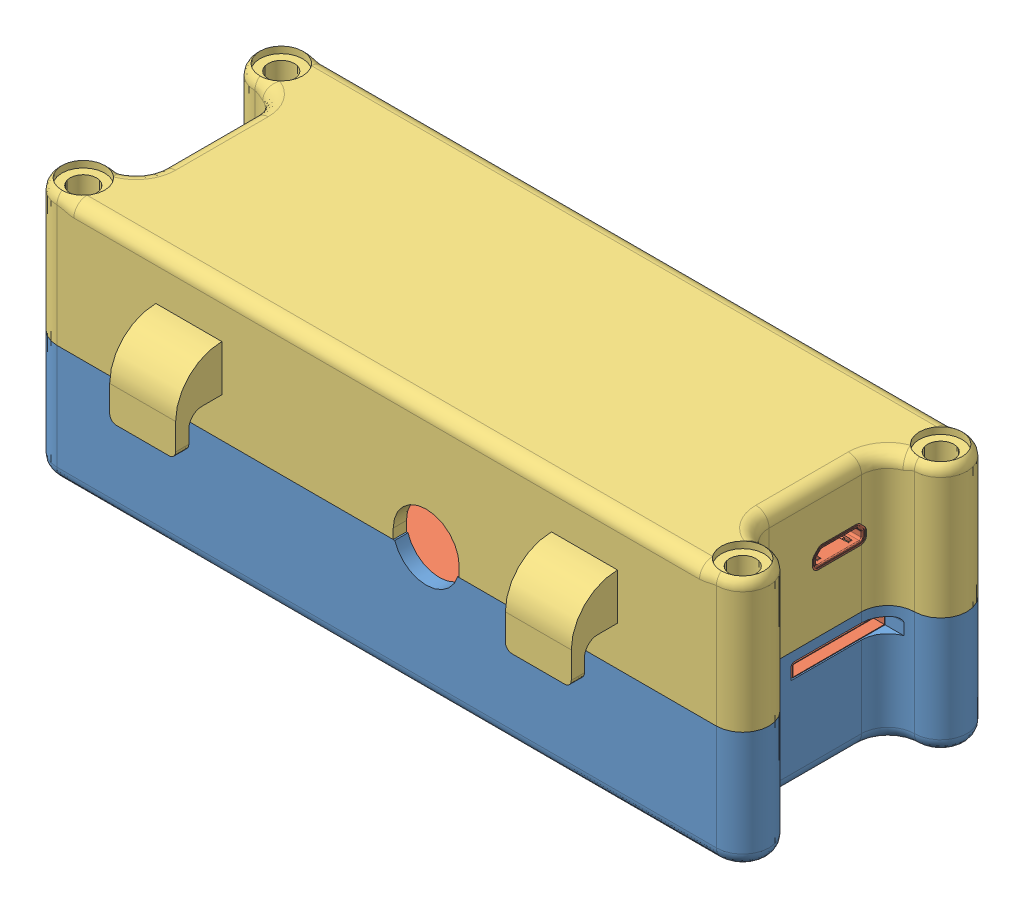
SolidWorks assembly 130916_Assembly_v0.2.1.sldasm, configuration Default (file format 9000). Lengths in mm.
Overall size (108 38.19 45.02).
3 component instances, 3 part files, 0 mates.
Components (placement in the parent):
- 130916_BottomCase_v0.2-1: 130916_BottomCase_v0.2.sldprt [Default] at (54.9489 49.1258 87.5306) size (108 20 38.02)
- 130916_PCB_draftBox_v0.2-1: 130916_PCB_draftBox_v0.2.sldprt [Default] at (54.9434 62.1258 87.7563) size (90 20.2 35.5)
- 130916_TopCase_v0.2-1: 130916_TopCase_v0.2.sldprt [Default] at (54.9489 87.1258 87.5306) x (1 0 0) z (0 0 -1) size (108 21.78 45.02)
